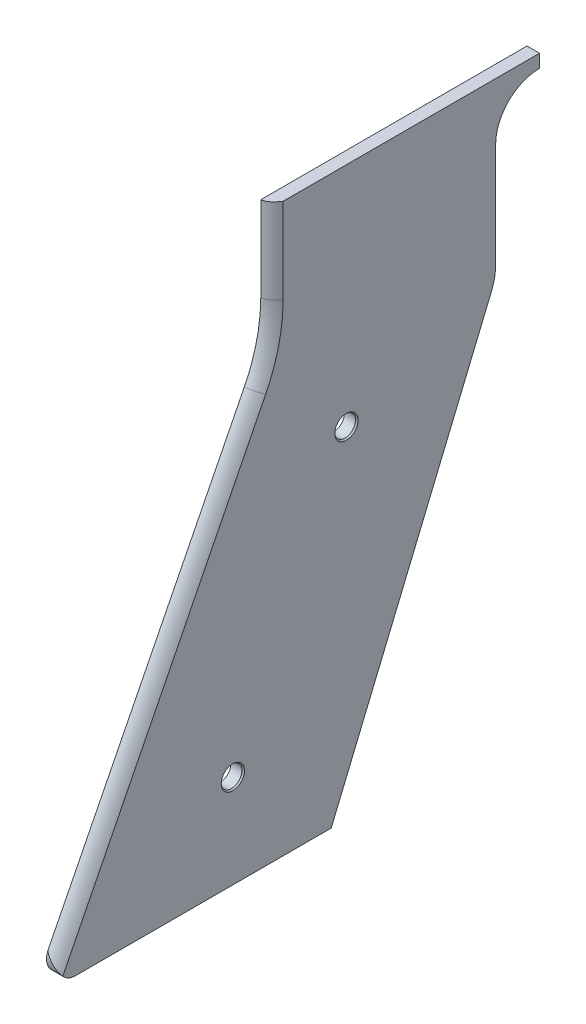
ISO-10303-21;
HEADER;
FILE_DESCRIPTION(('STEP AP214'),'2;1');
FILE_NAME('part.step','',(''),(''),'','','');
FILE_SCHEMA(('AUTOMOTIVE_DESIGN { 1 0 10303 214 1 1 1 1 }'));
ENDSEC;
DATA;
#1=APPLICATION_CONTEXT('core data for automotive mechanical design processes');
#2=APPLICATION_PROTOCOL_DEFINITION('international standard','automotive_design',2000,#1);
#3=PRODUCT_CONTEXT('',#1,'mechanical');
#4=PRODUCT('Part','Part','',(#3));
#5=PRODUCT_RELATED_PRODUCT_CATEGORY('part','',(#4));
#6=PRODUCT_DEFINITION_FORMATION('','',#4);
#7=PRODUCT_DEFINITION_CONTEXT('part definition',#1,'design');
#8=PRODUCT_DEFINITION('design','',#6,#7);
#9=PRODUCT_DEFINITION_SHAPE('','',#8);
#10=(LENGTH_UNIT() NAMED_UNIT(*) SI_UNIT(.MILLI.,.METRE.));
#11=(NAMED_UNIT(*) PLANE_ANGLE_UNIT() SI_UNIT($,.RADIAN.));
#12=(NAMED_UNIT(*) SI_UNIT($,.STERADIAN.) SOLID_ANGLE_UNIT());
#13=UNCERTAINTY_MEASURE_WITH_UNIT(LENGTH_MEASURE(1.E-05),#10,'distance_accuracy_value','');
#14=(GEOMETRIC_REPRESENTATION_CONTEXT(3) GLOBAL_UNCERTAINTY_ASSIGNED_CONTEXT((#13)) GLOBAL_UNIT_ASSIGNED_CONTEXT((#10,
#11,#12)) REPRESENTATION_CONTEXT('',''));
#15=CARTESIAN_POINT('',(0.,0.,0.));
#16=DIRECTION('',(0.,0.,1.));
#17=DIRECTION('',(1.,0.,0.));
#18=AXIS2_PLACEMENT_3D('',#15,#16,#17);
#19=CARTESIAN_POINT('',(0.,79.6090693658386,18.7495007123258));
#20=DIRECTION('',(-1.,0.,0.));
#21=DIRECTION('',(0.,0.,1.));
#22=AXIS2_PLACEMENT_3D('',#19,#20,#21);
#23=PLANE('',#22);
#24=CARTESIAN_POINT('',(0.,-5.3110442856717,26.8327416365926));
#25=DIRECTION('',(-1.,0.,0.));
#26=DIRECTION('',(0.,0.,1.));
#27=AXIS2_PLACEMENT_3D('',#24,#25,#26);
#28=CIRCLE('',#27,3.00000000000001);
#29=CARTESIAN_POINT('',(1.40516375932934E-10,-3.96089212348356,29.5117506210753));
#30=VERTEX_POINT('',#29);
#31=CARTESIAN_POINT('',(0.,-8.31104428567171,26.8327416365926));
#32=VERTEX_POINT('',#31);
#33=EDGE_CURVE('E369',#30,#32,#28,.F.);
#34=ORIENTED_EDGE('',*,*,#33,.F.);
#35=CARTESIAN_POINT('',(1.61729640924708E-11,67.007649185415,-6.25458314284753));
#36=CARTESIAN_POINT('',(-6.23106974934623E-12,40.6461064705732,7.03096166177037));
#37=CARTESIAN_POINT('',(3.36979167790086E-12,14.2845637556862,20.3165064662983));
#38=CARTESIAN_POINT('',(1.61720967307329E-11,-12.0769789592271,33.6020512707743));
#39=(BOUNDED_CURVE() B_SPLINE_CURVE(3,(#35,#36,#37,#38),.UNSPECIFIED.,.F.,
.F.) B_SPLINE_CURVE_WITH_KNOTS((4,4),(0.,0.0885603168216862),
.UNSPECIFIED.) CURVE() GEOMETRIC_REPRESENTATION_ITEM() RATIONAL_B_SPLINE_CURVE((0.999999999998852,
0.999999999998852,0.999999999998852,0.999999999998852)) REPRESENTATION_ITEM(''));
#40=CARTESIAN_POINT('',(0.,67.0076491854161,-6.25458314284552));
#41=VERTEX_POINT('',#40);
#42=EDGE_CURVE('E75',#41,#30,#39,.T.);
#43=ORIENTED_EDGE('',*,*,#42,.F.);
#44=CARTESIAN_POINT('',(0.,79.6090693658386,-9.2504992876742));
#45=CARTESIAN_POINT('',(6.86447822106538E-13,77.430516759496,-9.25049928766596));
#46=CARTESIAN_POINT('',(-6.86865962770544E-13,75.2521702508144,-8.99510789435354));
#47=CARTESIAN_POINT('',(6.8643228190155E-13,71.0133122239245,-7.98734345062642));
#48=CARTESIAN_POINT('',(-4.46310346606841E-12,68.9531031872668,-7.23504231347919));
#49=CARTESIAN_POINT('',(0.,67.0076491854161,-6.25458314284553));
#50=(BOUNDED_CURVE() B_SPLINE_CURVE(3,(#44,#45,#46,#47,#48,#49),.UNSPECIFIED.,.F.,
.F.) B_SPLINE_CURVE_WITH_KNOTS((4,2,4),(3.14159265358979,3.37500372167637,3.60841478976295),
.UNSPECIFIED.) CURVE() GEOMETRIC_REPRESENTATION_ITEM() RATIONAL_B_SPLINE_CURVE((1.,1.,1.,1.,1.,1.)) REPRESENTATION_ITEM(''));
#51=CARTESIAN_POINT('',(0.,79.6090693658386,-9.2504992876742));
#52=VERTEX_POINT('',#51);
#53=EDGE_CURVE('E183',#52,#41,#50,.T.);
#54=ORIENTED_EDGE('',*,*,#53,.F.);
#55=CARTESIAN_POINT('',(0.,95.8629500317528,-9.2504992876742));
#56=CARTESIAN_POINT('',(0.,90.4449898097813,-9.2504992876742));
#57=CARTESIAN_POINT('',(0.,85.0270295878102,-9.2504992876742));
#58=CARTESIAN_POINT('',(0.,79.6090693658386,-9.2504992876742));
#59=(BOUNDED_CURVE() B_SPLINE_CURVE(3,(#55,#56,#57,#58),.UNSPECIFIED.,.F.,
.F.) B_SPLINE_CURVE_WITH_KNOTS((4,4),(-0.0162538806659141,0.),
.UNSPECIFIED.) CURVE() GEOMETRIC_REPRESENTATION_ITEM() RATIONAL_B_SPLINE_CURVE((1.,1.,1.,1.)) REPRESENTATION_ITEM(''));
#60=CARTESIAN_POINT('',(0.,95.0889557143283,-9.2504992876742));
#61=VERTEX_POINT('',#60);
#62=EDGE_CURVE('E293',#61,#52,#59,.T.);
#63=ORIENTED_EDGE('',*,*,#62,.F.);
#64=DIRECTION('',(0.,0.,1.));
#65=VECTOR('',#64,1.);
#66=CARTESIAN_POINT('',(0.,95.0889557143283,-57.8074690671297));
#67=LINE('',#66,#65);
#68=CARTESIAN_POINT('',(0.,95.0889557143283,-57.8074690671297));
#69=VERTEX_POINT('',#68);
#70=EDGE_CURVE('E201',#69,#61,#67,.T.);
#71=ORIENTED_EDGE('',*,*,#70,.F.);
#72=DIRECTION('',(0.,1.,0.));
#73=VECTOR('',#72,1.);
#74=CARTESIAN_POINT('',(0.,92.6889557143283,-57.8074690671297));
#75=LINE('',#74,#73);
#76=CARTESIAN_POINT('',(0.,92.6889557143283,-57.8074690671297));
#77=VERTEX_POINT('',#76);
#78=EDGE_CURVE('E173',#77,#69,#75,.T.);
#79=ORIENTED_EDGE('',*,*,#78,.F.);
#80=CARTESIAN_POINT('',(0.,84.6889557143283,-57.8074690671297));
#81=DIRECTION('',(-1.,0.,0.));
#82=DIRECTION('',(0.,0.,1.));
#83=AXIS2_PLACEMENT_3D('',#80,#81,#82);
#84=CIRCLE('',#83,8.);
#85=CARTESIAN_POINT('',(0.,84.6889557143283,-49.8074690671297));
#86=VERTEX_POINT('',#85);
#87=EDGE_CURVE('E392',#86,#77,#84,.T.);
#88=ORIENTED_EDGE('',*,*,#87,.F.);
#89=DIRECTION('',(0.,1.,0.));
#90=VECTOR('',#89,1.);
#91=CARTESIAN_POINT('',(0.,65.6889557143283,-49.8074690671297));
#92=LINE('',#91,#90);
#93=CARTESIAN_POINT('',(0.,65.6889557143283,-49.8074690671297));
#94=VERTEX_POINT('',#93);
#95=EDGE_CURVE('E389',#94,#86,#92,.T.);
#96=ORIENTED_EDGE('',*,*,#95,.F.);
#97=CARTESIAN_POINT('',(0.,65.6889557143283,-39.8074690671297));
#98=DIRECTION('',(1.,0.,0.));
#99=DIRECTION('',(0.,0.,1.));
#100=AXIS2_PLACEMENT_3D('',#97,#98,#99);
#101=CIRCLE('',#100,10.);
#102=CARTESIAN_POINT('',(0.,61.8428018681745,-49.038238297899));
#103=VERTEX_POINT('',#102);
#104=EDGE_CURVE('E385',#103,#94,#101,.T.);
#105=ORIENTED_EDGE('',*,*,#104,.F.);
#106=DIRECTION('',(0.,0.923076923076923,-0.384615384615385));
#107=VECTOR('',#106,1.);
#108=CARTESIAN_POINT('',(0.,61.8428018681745,-49.038238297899));
#109=LINE('',#108,#107);
#110=CARTESIAN_POINT('',(0.,-8.3110442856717,-19.8074690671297));
#111=VERTEX_POINT('',#110);
#112=EDGE_CURVE('E381',#111,#103,#109,.T.);
#113=ORIENTED_EDGE('',*,*,#112,.F.);
#114=DIRECTION('',(0.,0.,-1.));
#115=VECTOR('',#114,1.);
#116=CARTESIAN_POINT('',(0.,-8.3110442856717,-19.8074690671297));
#117=LINE('',#116,#115);
#118=EDGE_CURVE('E304',#32,#111,#117,.T.);
#119=ORIENTED_EDGE('',*,*,#118,.F.);
#120=EDGE_LOOP('',(#34,#43,#54,#63,#71,#79,#88,#96,#105,#113,#119));
#121=FACE_BOUND('',#120,.T.);
#122=CARTESIAN_POINT('',(0.,53.6889557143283,-22.5915519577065));
#123=DIRECTION('',(1.,0.,0.));
#124=DIRECTION('',(0.,0.,-1.));
#125=AXIS2_PLACEMENT_3D('',#122,#123,#124);
#126=CIRCLE('',#125,1.905);
#127=CARTESIAN_POINT('',(0.,53.6889557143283,-24.4965519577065));
#128=VERTEX_POINT('',#127);
#129=EDGE_CURVE('E376',#128,#128,#126,.T.);
#130=ORIENTED_EDGE('',*,*,#129,.T.);
#131=EDGE_LOOP('',(#130));
#132=FACE_BOUND('',#131,.T.);
#133=CARTESIAN_POINT('',(0.,8.68895571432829,-1.87712613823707));
#134=DIRECTION('',(1.,0.,0.));
#135=DIRECTION('',(0.,0.,-1.));
#136=AXIS2_PLACEMENT_3D('',#133,#134,#135);
#137=CIRCLE('',#136,1.905);
#138=CARTESIAN_POINT('',(0.,8.68895571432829,-3.78212613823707));
#139=VERTEX_POINT('',#138);
#140=EDGE_CURVE('E373',#139,#139,#137,.T.);
#141=ORIENTED_EDGE('',*,*,#140,.T.);
#142=EDGE_LOOP('',(#141));
#143=FACE_BOUND('',#142,.T.);
#144=ADVANCED_FACE('F45',(#121,#132,#143),#23,.T.);
#145=CARTESIAN_POINT('',(4.572,-8.3110442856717,-19.8074690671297));
#146=DIRECTION('',(0.,1.,0.));
#147=DIRECTION('',(0.,0.,1.));
#148=AXIS2_PLACEMENT_3D('',#145,#146,#147);
#149=PLANE('',#148);
#150=DIRECTION('',(-1.,0.,0.));
#151=VECTOR('',#150,1.);
#152=CARTESIAN_POINT('',(4.572,-8.3110442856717,-19.8074690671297));
#153=LINE('',#152,#151);
#154=CARTESIAN_POINT('',(2.286,-8.3110442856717,-19.8074690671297));
#155=VERTEX_POINT('',#154);
#156=EDGE_CURVE('E195',#155,#111,#153,.T.);
#157=ORIENTED_EDGE('',*,*,#156,.F.);
#158=DIRECTION('',(0.,0.,1.));
#159=VECTOR('',#158,1.);
#160=CARTESIAN_POINT('',(2.286,-8.3110442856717,-19.8074690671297));
#161=LINE('',#160,#159);
#162=CARTESIAN_POINT('',(2.28600000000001,-8.31104428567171,26.8327416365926));
#163=VERTEX_POINT('',#162);
#164=EDGE_CURVE('E320',#155,#163,#161,.T.);
#165=ORIENTED_EDGE('',*,*,#164,.T.);
#166=DIRECTION('',(1.,0.,0.));
#167=VECTOR('',#166,1.);
#168=CARTESIAN_POINT('',(-0.0317599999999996,-8.31104428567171,26.8327416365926));
#169=LINE('',#168,#167);
#170=EDGE_CURVE('E364',#32,#163,#169,.T.);
#171=ORIENTED_EDGE('',*,*,#170,.F.);
#172=ORIENTED_EDGE('',*,*,#118,.T.);
#173=EDGE_LOOP('',(#157,#165,#171,#172));
#174=FACE_BOUND('',#173,.T.);
#175=ADVANCED_FACE('F232',(#174),#149,.F.);
#176=CARTESIAN_POINT('',(4.572,61.8428018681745,-49.038238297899));
#177=DIRECTION('',(0.,0.384615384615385,0.923076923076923));
#178=DIRECTION('',(0.,-0.923076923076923,0.384615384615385));
#179=AXIS2_PLACEMENT_3D('',#176,#177,#178);
#180=PLANE('',#179);
#181=DIRECTION('',(-1.,0.,0.));
#182=VECTOR('',#181,1.);
#183=CARTESIAN_POINT('',(4.572,61.8428018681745,-49.038238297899));
#184=LINE('',#183,#182);
#185=CARTESIAN_POINT('',(2.286,61.8428018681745,-49.038238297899));
#186=VERTEX_POINT('',#185);
#187=EDGE_CURVE('E192',#186,#103,#184,.T.);
#188=ORIENTED_EDGE('',*,*,#187,.F.);
#189=DIRECTION('',(0.,-0.923076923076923,0.384615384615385));
#190=VECTOR('',#189,1.);
#191=CARTESIAN_POINT('',(2.286,61.8428018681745,-49.038238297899));
#192=LINE('',#191,#190);
#193=EDGE_CURVE('E346',#186,#155,#192,.T.);
#194=ORIENTED_EDGE('',*,*,#193,.T.);
#195=ORIENTED_EDGE('',*,*,#156,.T.);
#196=ORIENTED_EDGE('',*,*,#112,.T.);
#197=EDGE_LOOP('',(#188,#194,#195,#196));
#198=FACE_BOUND('',#197,.T.);
#199=ADVANCED_FACE('F228',(#198),#180,.F.);
#200=CARTESIAN_POINT('',(4.572,65.6889557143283,-39.8074690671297));
#201=DIRECTION('',(-1.,0.,0.));
#202=DIRECTION('',(0.,0.,1.));
#203=AXIS2_PLACEMENT_3D('',#200,#201,#202);
#204=CYLINDRICAL_SURFACE('',#203,10.);
#205=DIRECTION('',(-1.,0.,0.));
#206=VECTOR('',#205,1.);
#207=CARTESIAN_POINT('',(4.572,65.6889557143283,-49.8074690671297));
#208=LINE('',#207,#206);
#209=CARTESIAN_POINT('',(2.286,65.6889557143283,-49.8074690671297));
#210=VERTEX_POINT('',#209);
#211=EDGE_CURVE('E189',#210,#94,#208,.T.);
#212=ORIENTED_EDGE('',*,*,#211,.F.);
#213=CARTESIAN_POINT('',(2.286,65.6889557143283,-39.8074690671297));
#214=DIRECTION('',(-1.,0.,0.));
#215=DIRECTION('',(0.,0.,1.));
#216=AXIS2_PLACEMENT_3D('',#213,#214,#215);
#217=CIRCLE('',#216,10.);
#218=EDGE_CURVE('E352',#210,#186,#217,.T.);
#219=ORIENTED_EDGE('',*,*,#218,.T.);
#220=ORIENTED_EDGE('',*,*,#187,.T.);
#221=ORIENTED_EDGE('',*,*,#104,.T.);
#222=EDGE_LOOP('',(#212,#219,#220,#221));
#223=FACE_BOUND('',#222,.T.);
#224=ADVANCED_FACE('F224',(#223),#204,.T.);
#225=CARTESIAN_POINT('',(4.572,65.6889557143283,-49.8074690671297));
#226=DIRECTION('',(0.,0.,1.));
#227=DIRECTION('',(0.,-1.,0.));
#228=AXIS2_PLACEMENT_3D('',#225,#226,#227);
#229=PLANE('',#228);
#230=DIRECTION('',(-1.,0.,0.));
#231=VECTOR('',#230,1.);
#232=CARTESIAN_POINT('',(4.572,84.6889557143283,-49.8074690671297));
#233=LINE('',#232,#231);
#234=CARTESIAN_POINT('',(2.286,84.6889557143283,-49.8074690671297));
#235=VERTEX_POINT('',#234);
#236=EDGE_CURVE('E180',#235,#86,#233,.T.);
#237=ORIENTED_EDGE('',*,*,#236,.F.);
#238=DIRECTION('',(0.,-1.,0.));
#239=VECTOR('',#238,1.);
#240=CARTESIAN_POINT('',(2.286,65.6889557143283,-49.8074690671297));
#241=LINE('',#240,#239);
#242=EDGE_CURVE('E358',#235,#210,#241,.T.);
#243=ORIENTED_EDGE('',*,*,#242,.T.);
#244=ORIENTED_EDGE('',*,*,#211,.T.);
#245=ORIENTED_EDGE('',*,*,#95,.T.);
#246=EDGE_LOOP('',(#237,#243,#244,#245));
#247=FACE_BOUND('',#246,.T.);
#248=ADVANCED_FACE('F220',(#247),#229,.F.);
#249=CARTESIAN_POINT('',(4.572,84.6889557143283,-57.8074690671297));
#250=DIRECTION('',(-1.,0.,0.));
#251=DIRECTION('',(0.,0.,1.));
#252=AXIS2_PLACEMENT_3D('',#249,#250,#251);
#253=CYLINDRICAL_SURFACE('',#252,8.);
#254=DIRECTION('',(-1.,0.,0.));
#255=VECTOR('',#254,1.);
#256=CARTESIAN_POINT('',(4.572,92.6889557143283,-57.8074690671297));
#257=LINE('',#256,#255);
#258=CARTESIAN_POINT('',(2.286,92.6889557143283,-57.8074690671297));
#259=VERTEX_POINT('',#258);
#260=EDGE_CURVE('E176',#259,#77,#257,.T.);
#261=ORIENTED_EDGE('',*,*,#260,.F.);
#262=CARTESIAN_POINT('',(2.286,84.6889557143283,-57.8074690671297));
#263=DIRECTION('',(-1.,0.,0.));
#264=DIRECTION('',(0.,0.,1.));
#265=AXIS2_PLACEMENT_3D('',#262,#263,#264);
#266=CIRCLE('',#265,8.);
#267=EDGE_CURVE('E154',#259,#235,#266,.F.);
#268=ORIENTED_EDGE('',*,*,#267,.T.);
#269=ORIENTED_EDGE('',*,*,#236,.T.);
#270=ORIENTED_EDGE('',*,*,#87,.T.);
#271=EDGE_LOOP('',(#261,#268,#269,#270));
#272=FACE_BOUND('',#271,.T.);
#273=ADVANCED_FACE('F217',(#272),#253,.F.);
#274=CARTESIAN_POINT('',(4.572,92.6889557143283,-57.8074690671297));
#275=DIRECTION('',(0.,0.,1.));
#276=DIRECTION('',(1.,0.,0.));
#277=AXIS2_PLACEMENT_3D('',#274,#275,#276);
#278=PLANE('',#277);
#279=DIRECTION('',(-1.,0.,0.));
#280=VECTOR('',#279,1.);
#281=CARTESIAN_POINT('',(4.572,95.0889557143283,-57.8074690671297));
#282=LINE('',#281,#280);
#283=CARTESIAN_POINT('',(2.286,95.0889557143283,-57.8074690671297));
#284=VERTEX_POINT('',#283);
#285=EDGE_CURVE('E164',#284,#69,#282,.T.);
#286=ORIENTED_EDGE('',*,*,#285,.F.);
#287=DIRECTION('',(0.,1.,0.));
#288=VECTOR('',#287,1.);
#289=CARTESIAN_POINT('',(2.286,-12.7655379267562,-57.8074690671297));
#290=LINE('',#289,#288);
#291=EDGE_CURVE('E148',#259,#284,#290,.T.);
#292=ORIENTED_EDGE('',*,*,#291,.F.);
#293=ORIENTED_EDGE('',*,*,#260,.T.);
#294=ORIENTED_EDGE('',*,*,#78,.T.);
#295=EDGE_LOOP('',(#286,#292,#293,#294));
#296=FACE_BOUND('',#295,.T.);
#297=ADVANCED_FACE('F171',(#296),#278,.F.);
#298=CARTESIAN_POINT('',(4.572,95.0889557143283,-57.8074690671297));
#299=DIRECTION('',(0.,-1.,0.));
#300=DIRECTION('',(0.,0.,-1.));
#301=AXIS2_PLACEMENT_3D('',#298,#299,#300);
#302=PLANE('',#301);
#303=CARTESIAN_POINT('',(4.572,95.0889557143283,-21.8254233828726));
#304=CARTESIAN_POINT('',(4.572,95.0889557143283,-9.89694581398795));
#305=CARTESIAN_POINT('',(0.,95.0889557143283,-9.2504992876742));
#306=(BOUNDED_CURVE() B_SPLINE_CURVE(2,(#303,#304,#305),.UNSPECIFIED.,.F.,
.F.) B_SPLINE_CURVE_WITH_KNOTS((3,3),(0.,1.),
.UNSPECIFIED.) CURVE() GEOMETRIC_REPRESENTATION_ITEM() RATIONAL_B_SPLINE_CURVE((1.,
0.754983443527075,1.)) REPRESENTATION_ITEM(''));
#307=CARTESIAN_POINT('',(2.28600000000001,95.0889557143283,-11.0528433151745));
#308=VERTEX_POINT('',#307);
#309=EDGE_CURVE('E167',#61,#308,#306,.F.);
#310=ORIENTED_EDGE('',*,*,#309,.T.);
#311=DIRECTION('',(0.,0.,1.));
#312=VECTOR('',#311,1.);
#313=CARTESIAN_POINT('',(2.286,95.0889557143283,-57.8074690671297));
#314=LINE('',#313,#312);
#315=EDGE_CURVE('E151',#284,#308,#314,.T.);
#316=ORIENTED_EDGE('',*,*,#315,.F.);
#317=ORIENTED_EDGE('',*,*,#285,.T.);
#318=ORIENTED_EDGE('',*,*,#70,.T.);
#319=EDGE_LOOP('',(#310,#316,#317,#318));
#320=FACE_BOUND('',#319,.T.);
#321=ADVANCED_FACE('F163',(#320),#302,.F.);
#322=CARTESIAN_POINT('',(4.572,53.6889557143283,-22.5915519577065));
#323=DIRECTION('',(-1.,0.,0.));
#324=DIRECTION('',(0.,0.,1.));
#325=AXIS2_PLACEMENT_3D('',#322,#323,#324);
#326=CYLINDRICAL_SURFACE('',#325,1.905);
#327=CARTESIAN_POINT('',(2.03199999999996,53.6889557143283,-22.5915519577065));
#328=DIRECTION('',(-1.,0.,0.));
#329=DIRECTION('',(0.,0.,1.));
#330=AXIS2_PLACEMENT_3D('',#327,#328,#329);
#331=CIRCLE('',#330,1.905);
#332=CARTESIAN_POINT('',(2.03199999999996,53.6889557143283,-20.6865519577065));
#333=VERTEX_POINT('',#332);
#334=EDGE_CURVE('E12',#333,#333,#331,.F.);
#335=ORIENTED_EDGE('',*,*,#334,.T.);
#336=EDGE_LOOP('',(#335));
#337=FACE_BOUND('',#336,.T.);
#338=ORIENTED_EDGE('',*,*,#129,.F.);
#339=EDGE_LOOP('',(#338));
#340=FACE_BOUND('',#339,.T.);
#341=ADVANCED_FACE('F212',(#337,#340),#326,.F.);
#342=CARTESIAN_POINT('',(4.572,8.68895571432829,-1.87712613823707));
#343=DIRECTION('',(-1.,0.,0.));
#344=DIRECTION('',(0.,0.,1.));
#345=AXIS2_PLACEMENT_3D('',#342,#343,#344);
#346=CYLINDRICAL_SURFACE('',#345,1.905);
#347=CARTESIAN_POINT('',(2.03199999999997,8.68895571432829,-1.87712613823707));
#348=DIRECTION('',(-1.,0.,0.));
#349=DIRECTION('',(0.,0.,1.));
#350=AXIS2_PLACEMENT_3D('',#347,#348,#349);
#351=CIRCLE('',#350,1.905);
#352=CARTESIAN_POINT('',(2.03199999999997,8.68895571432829,0.0278738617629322));
#353=VERTEX_POINT('',#352);
#354=EDGE_CURVE('E56',#353,#353,#351,.F.);
#355=ORIENTED_EDGE('',*,*,#354,.T.);
#356=EDGE_LOOP('',(#355));
#357=FACE_BOUND('',#356,.T.);
#358=ORIENTED_EDGE('',*,*,#140,.F.);
#359=EDGE_LOOP('',(#358));
#360=FACE_BOUND('',#359,.T.);
#361=ADVANCED_FACE('F483',(#357,#360),#346,.F.);
#362=CARTESIAN_POINT('',(4.572,61.3482955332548,-17.4840280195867));
#363=CARTESIAN_POINT('',(4.572,34.9867528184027,-4.19848321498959));
#364=CARTESIAN_POINT('',(4.572,8.62521010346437,9.08706158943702));
#365=CARTESIAN_POINT('',(4.572,-17.7363326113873,22.3726063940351));
#366=CARTESIAN_POINT('',(4.572,66.7167154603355,-6.83186182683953));
#367=CARTESIAN_POINT('',(4.572,40.3551727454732,6.4536829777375));
#368=CARTESIAN_POINT('',(4.57199999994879,13.9936300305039,19.7392277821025));
#369=CARTESIAN_POINT('',(4.572,-12.3679126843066,33.0247725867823));
#370=CARTESIAN_POINT('',(0.,67.007649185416,-6.25458314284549));
#371=CARTESIAN_POINT('',(-2.24031664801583E-11,40.6461064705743,7.03096166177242));
#372=CARTESIAN_POINT('',(-1.28023050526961E-11,14.2845637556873,20.3165064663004));
#373=CARTESIAN_POINT('',(0.,-12.0769789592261,33.6020512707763));
#374=(BOUNDED_SURFACE() B_SPLINE_SURFACE(2,3,((#362,#363,#364,#365),(#366,#367,#368,#369),(#370,
#371,#372,#373)),.UNSPECIFIED.,.F.,.F.,.F.) B_SPLINE_SURFACE_WITH_KNOTS((3,3),(4,4),(0.,1.),(0.,
0.0885603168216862),
.UNSPECIFIED.) GEOMETRIC_REPRESENTATION_ITEM() RATIONAL_B_SPLINE_SURFACE(((1.,1.,1.,1.),
(0.754983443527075,0.754983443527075,0.754983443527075,0.754983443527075),(1.,1.,1.,1.))) REPRESENTATION_ITEM('') SURFACE());
#375=CARTESIAN_POINT('',(2.28600000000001,66.1964528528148,-7.86418117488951));
#376=CARTESIAN_POINT('',(2.28600000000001,63.2370960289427,-6.3727408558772));
#377=CARTESIAN_POINT('',(2.28600000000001,60.2777392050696,-4.88130053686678));
#378=CARTESIAN_POINT('',(2.28600000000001,51.3996687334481,-0.406979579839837));
#379=CARTESIAN_POINT('',(2.28600000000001,45.4809550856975,2.57590105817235));
#380=CARTESIAN_POINT('',(2.28600000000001,33.6435277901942,8.54166233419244));
#381=CARTESIAN_POINT('',(2.28600000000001,27.7248141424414,11.5245429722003));
#382=CARTESIAN_POINT('',(2.28600000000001,11.9007571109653,19.4994638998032));
#383=CARTESIAN_POINT('',(2.28600000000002,1.99541372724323,24.4915041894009));
#384=CARTESIAN_POINT('',(2.28600000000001,-7.90992965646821,29.4835444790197));
#385=B_SPLINE_CURVE_WITH_KNOTS('',3,(#375,#376,#377,#378,#379,#380,#381,#382,#383,#384),
.UNSPECIFIED.,.F.,.F.,(4,2,2,2,4),(0.,9.94181489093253,29.8254446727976,49.7090744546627,
82.9855923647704),.UNSPECIFIED.);
#386=CARTESIAN_POINT('',(2.28600000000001,66.1964528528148,-7.86418117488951));
#387=VERTEX_POINT('',#386);
#388=CARTESIAN_POINT('',(2.28600000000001,-7.22839652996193,29.1400691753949));
#389=VERTEX_POINT('',#388);
#390=EDGE_CURVE('E64',#387,#389,#385,.T.);
#391=CARTESIAN_POINT('',(0.,67.0076491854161,-6.25458314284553));
#392=CARTESIAN_POINT('',(4.572,66.7167154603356,-6.83186182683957));
#393=CARTESIAN_POINT('',(4.572,61.3482955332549,-17.4840280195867));
#394=(BOUNDED_CURVE() B_SPLINE_CURVE(2,(#391,#392,#393),.UNSPECIFIED.,.F.,
.F.) B_SPLINE_CURVE_WITH_KNOTS((3,3),(0.,1.),
.UNSPECIFIED.) CURVE() GEOMETRIC_REPRESENTATION_ITEM() RATIONAL_B_SPLINE_CURVE((1.,
0.754983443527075,1.)) REPRESENTATION_ITEM(''));
#395=EDGE_CURVE('E377',#41,#387,#394,.T.);
#396=CARTESIAN_POINT('',(3.43793325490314,-8.3110442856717,26.8327416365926));
#397=CARTESIAN_POINT('',(3.41222037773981,-8.31105666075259,26.9210966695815));
#398=CARTESIAN_POINT('',(3.38535990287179,-8.30714158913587,27.0091009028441));
#399=CARTESIAN_POINT('',(3.32938204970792,-8.29173199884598,27.1836781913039));
#400=CARTESIAN_POINT('',(3.30026562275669,-8.28024065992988,27.270251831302));
#401=CARTESIAN_POINT('',(3.23991150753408,-8.25001311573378,27.4409771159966));
#402=CARTESIAN_POINT('',(3.20868261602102,-8.23130559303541,27.5251369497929));
#403=CARTESIAN_POINT('',(3.14406047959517,-8.18700961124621,27.6907516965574));
#404=CARTESIAN_POINT('',(3.11066706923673,-8.16142062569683,27.7722064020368));
#405=CARTESIAN_POINT('',(3.00740923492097,-8.07497883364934,28.0114371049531));
#406=CARTESIAN_POINT('',(2.93434020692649,-8.0043846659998,28.1644426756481));
#407=CARTESIAN_POINT('',(2.78039463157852,-7.84091830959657,28.4536718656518));
#408=CARTESIAN_POINT('',(2.69951175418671,-7.74802796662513,28.5898816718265));
#409=CARTESIAN_POINT('',(2.52518397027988,-7.53727329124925,28.8511224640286));
#410=CARTESIAN_POINT('',(2.43126327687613,-7.4181718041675,28.974837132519));
#411=CARTESIAN_POINT('',(2.23652256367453,-7.16411680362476,29.198063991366));
#412=CARTESIAN_POINT('',(2.13570151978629,-7.02916093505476,29.2975725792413));
#413=CARTESIAN_POINT('',(1.91745797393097,-6.7334120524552,29.4804102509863));
#414=CARTESIAN_POINT('',(1.79939869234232,-6.57139129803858,29.5609863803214));
#415=CARTESIAN_POINT('',(1.5575048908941,-6.23912346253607,29.691158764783));
#416=CARTESIAN_POINT('',(1.43366350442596,-6.06886659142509,29.7407171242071));
#417=CARTESIAN_POINT('',(1.23783492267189,-5.80156322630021,29.7939767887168));
#418=CARTESIAN_POINT('',(1.16718551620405,-5.7055045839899,29.8082671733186));
#419=CARTESIAN_POINT('',(1.02492489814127,-5.51310819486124,29.8274890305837));
#420=CARTESIAN_POINT('',(0.953313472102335,-5.41677038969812,29.8324183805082));
#421=CARTESIAN_POINT('',(0.809730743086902,-5.22470728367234,29.8330335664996));
#422=CARTESIAN_POINT('',(0.737760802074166,-5.12898105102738,29.8287426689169));
#423=CARTESIAN_POINT('',(0.629936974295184,-4.98599436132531,29.8154638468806));
#424=CARTESIAN_POINT('',(0.594022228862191,-4.93843874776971,29.8098983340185));
#425=CARTESIAN_POINT('',(0.522372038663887,-4.84351858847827,29.7964754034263));
#426=CARTESIAN_POINT('',(0.486636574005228,-4.79615402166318,29.7886182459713));
#427=CARTESIAN_POINT('',(0.427307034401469,-4.71718453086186,29.7735527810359));
#428=CARTESIAN_POINT('',(0.403600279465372,-4.68554015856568,29.7669869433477));
#429=CARTESIAN_POINT('',(0.356481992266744,-4.62227343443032,29.7527837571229));
#430=CARTESIAN_POINT('',(0.333070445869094,-4.59065108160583,29.7451464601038));
#431=CARTESIAN_POINT('',(0.286631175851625,-4.52724647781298,29.728728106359));
#432=CARTESIAN_POINT('',(0.263605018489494,-4.49546404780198,29.7199432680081));
#433=CARTESIAN_POINT('',(0.218318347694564,-4.43171805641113,29.701171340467));
#434=CARTESIAN_POINT('',(0.196057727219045,-4.39975452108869,29.6911844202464));
#435=CARTESIAN_POINT('',(0.149262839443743,-4.33018113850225,29.6681366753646));
#436=CARTESIAN_POINT('',(0.124946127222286,-4.29249704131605,29.6548400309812));
#437=CARTESIAN_POINT('',(0.0911359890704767,-4.23523551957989,29.6332852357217));
#438=CARTESIAN_POINT('',(0.0803510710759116,-4.21611005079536,29.6258674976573));
#439=CARTESIAN_POINT('',(0.0600281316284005,-4.17744158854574,29.6103987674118));
#440=CARTESIAN_POINT('',(0.0504900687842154,-4.15789860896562,29.602347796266));
#441=CARTESIAN_POINT('',(0.0356993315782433,-4.12392315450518,29.5879150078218));
#442=CARTESIAN_POINT('',(0.0299985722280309,-4.10961377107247,29.5817076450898));
#443=CARTESIAN_POINT('',(0.0198382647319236,-4.08074556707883,29.5689094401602));
#444=CARTESIAN_POINT('',(0.015377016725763,-4.06618711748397,29.5623191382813));
#445=CARTESIAN_POINT('',(0.00795183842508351,-4.03657810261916,29.5486218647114));
#446=CARTESIAN_POINT('',(0.00501670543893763,-4.02152340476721,29.5415076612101));
#447=CARTESIAN_POINT('',(0.0010201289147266,-3.99126299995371,29.5268954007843));
#448=CARTESIAN_POINT('',(-3.19159966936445E-05,-3.9760569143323,29.5193956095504));
#449=CARTESIAN_POINT('',(1.40516378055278E-10,-3.96089212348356,29.5117506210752));
#450=B_SPLINE_CURVE_WITH_KNOTS('',3,(#396,#397,#398,#399,#400,#401,#402,#403,#404,#405,#406,
#407,#408,#409,#410,#411,#412,#413,#414,#415,#416,#417,#418,#419,#420,#421,#422,#423,#424,#425,
#426,#427,#428,#429,#430,#431,#432,#433,#434,#435,#436,#437,#438,#439,#440,#441,#442,#443,#444,
#445,#446,#447,#448,#449),.UNSPECIFIED.,.F.,.F.,(4,2,2,2,2,2,2,2,2,2,2,2,2,2,2,2,2,2,2,2,2,2,2,
2,2,2,4),(0.,0.275945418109,0.551775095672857,0.826519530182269,1.10128498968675,
1.64965948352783,2.19848200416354,2.78324730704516,3.36809958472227,4.01368132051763,
4.6600502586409,5.02001692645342,5.3800652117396,5.73920601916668,5.91872952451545,
6.09823264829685,6.21846233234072,6.3386862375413,6.45931682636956,6.57993047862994,
6.72012446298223,6.78962293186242,6.85911909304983,6.90889906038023,6.95861041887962,
7.0092285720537,7.06009866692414),.UNSPECIFIED.);
#451=EDGE_CURVE('E49',#389,#30,#450,.T.);
#452=ORIENTED_EDGE('',*,*,#390,.F.);
#453=ORIENTED_EDGE('',*,*,#395,.F.);
#454=ORIENTED_EDGE('',*,*,#42,.T.);
#455=ORIENTED_EDGE('',*,*,#451,.F.);
#456=EDGE_LOOP('',(#452,#453,#454,#455));
#457=FACE_BOUND('',#456,.T.);
#458=ADVANCED_FACE('F329',(#457),#374,.T.);
#459=CARTESIAN_POINT('',(4.572,79.6090693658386,-21.8254233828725));
#460=CARTESIAN_POINT('',(4.572,76.4521191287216,-21.8254233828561));
#461=CARTESIAN_POINT('',(4.572,73.2954675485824,-21.4553345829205));
#462=CARTESIAN_POINT('',(4.572,67.1529195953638,-19.9949786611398));
#463=CARTESIAN_POINT('',(4.572,64.1674615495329,-18.9048157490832));
#464=CARTESIAN_POINT('',(4.572,61.3482955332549,-17.4840280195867));
#465=CARTESIAN_POINT('',(4.572,79.6090693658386,-9.89694581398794));
#466=CARTESIAN_POINT('',(4.57199999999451,77.3802196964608,-9.89694581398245));
#467=CARTESIAN_POINT('',(4.57199999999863,75.1515808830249,-9.6356581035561));
#468=CARTESIAN_POINT('',(4.57200000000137,70.8148587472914,-8.60462702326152));
#469=CARTESIAN_POINT('',(4.57200000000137,68.7070848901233,-7.83495722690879));
#470=CARTESIAN_POINT('',(4.572,66.7167154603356,-6.83186182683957));
#471=CARTESIAN_POINT('',(0.,79.6090693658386,-9.2504992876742));
#472=CARTESIAN_POINT('',(6.86447822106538E-13,77.430516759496,-9.25049928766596));
#473=CARTESIAN_POINT('',(-6.86865962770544E-13,75.2521702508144,-8.99510789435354));
#474=CARTESIAN_POINT('',(6.8643228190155E-13,71.0133122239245,-7.98734345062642));
#475=CARTESIAN_POINT('',(-4.46310346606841E-12,68.9531031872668,-7.23504231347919));
#476=CARTESIAN_POINT('',(0.,67.0076491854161,-6.25458314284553));
#477=(BOUNDED_SURFACE() B_SPLINE_SURFACE(2,3,((#459,#460,#461,#462,#463,#464),(#465,#466,#467,
#468,#469,#470),(#471,#472,#473,#474,#475,#476)),.UNSPECIFIED.,.F.,.F.,
.F.) B_SPLINE_SURFACE_WITH_KNOTS((3,3),(4,2,4),(0.,1.),(3.14159265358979,3.37500372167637,
3.60841478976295),.UNSPECIFIED.) GEOMETRIC_REPRESENTATION_ITEM() RATIONAL_B_SPLINE_SURFACE(((1.,
1.,1.,1.,1.,1.),(0.754983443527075,0.754983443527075,0.754983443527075,0.754983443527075,
0.754983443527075,0.754983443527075),(1.,1.,1.,1.,1.,1.))) REPRESENTATION_ITEM('') SURFACE());
#478=CARTESIAN_POINT('',(2.28600000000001,79.6090693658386,-11.0529546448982));
#479=CARTESIAN_POINT('',(2.28600000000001,78.7826534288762,-11.0529547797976));
#480=CARTESIAN_POINT('',(2.28600000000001,77.9562214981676,-11.0184243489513));
#481=CARTESIAN_POINT('',(2.286,76.3092890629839,-10.8809844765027));
#482=CARTESIAN_POINT('',(2.28599999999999,75.4887869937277,-10.7780937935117));
#483=CARTESIAN_POINT('',(2.286,73.9464028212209,-10.5192464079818));
#484=CARTESIAN_POINT('',(2.286,73.2233625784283,-10.370146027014));
#485=CARTESIAN_POINT('',(2.28600000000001,71.7904135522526,-10.0185082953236));
#486=CARTESIAN_POINT('',(2.286,71.0805042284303,-9.81597314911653));
#487=CARTESIAN_POINT('',(2.286,69.6615679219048,-9.35367301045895));
#488=CARTESIAN_POINT('',(2.286,68.9529330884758,-9.0927041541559));
#489=CARTESIAN_POINT('',(2.28600000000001,67.5573650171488,-8.51779889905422));
#490=CARTESIAN_POINT('',(2.28600000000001,66.870435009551,-8.20385465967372));
#491=CARTESIAN_POINT('',(2.286,66.1964528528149,-7.86418117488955));
#492=B_SPLINE_CURVE_WITH_KNOTS('',3,(#478,#479,#480,#481,#482,#483,#484,#485,#486,#487,#488,
#489,#490,#491),.UNSPECIFIED.,.F.,.F.,(4,2,2,2,2,2,4),(0.,2.47857891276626,4.95647796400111,
7.16923316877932,9.38189709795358,11.6452085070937,13.9088551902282),.UNSPECIFIED.);
#493=CARTESIAN_POINT('',(2.28600000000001,79.6090693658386,-11.0529546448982));
#494=VERTEX_POINT('',#493);
#495=EDGE_CURVE('E345',#494,#387,#492,.T.);
#496=CARTESIAN_POINT('',(0.,79.6090693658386,-9.2504992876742));
#497=CARTESIAN_POINT('',(4.572,79.6090693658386,-9.89694581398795));
#498=CARTESIAN_POINT('',(4.572,79.6090693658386,-21.8254233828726));
#499=(BOUNDED_CURVE() B_SPLINE_CURVE(2,(#496,#497,#498),.UNSPECIFIED.,.F.,
.F.) B_SPLINE_CURVE_WITH_KNOTS((3,3),(0.,1.),
.UNSPECIFIED.) CURVE() GEOMETRIC_REPRESENTATION_ITEM() RATIONAL_B_SPLINE_CURVE((1.,
0.754983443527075,1.)) REPRESENTATION_ITEM(''));
#500=EDGE_CURVE('E283',#52,#494,#499,.T.);
#501=ORIENTED_EDGE('',*,*,#495,.F.);
#502=ORIENTED_EDGE('',*,*,#500,.F.);
#503=ORIENTED_EDGE('',*,*,#53,.T.);
#504=ORIENTED_EDGE('',*,*,#395,.T.);
#505=EDGE_LOOP('',(#501,#502,#503,#504));
#506=FACE_BOUND('',#505,.T.);
#507=ADVANCED_FACE('F248',(#506),#477,.T.);
#508=CARTESIAN_POINT('',(4.572,95.8629500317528,-21.8254233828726));
#509=CARTESIAN_POINT('',(4.572,90.4449898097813,-21.8254233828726));
#510=CARTESIAN_POINT('',(4.572,85.0270295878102,-21.8254233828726));
#511=CARTESIAN_POINT('',(4.572,79.6090693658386,-21.8254233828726));
#512=CARTESIAN_POINT('',(4.572,95.8629500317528,-9.89694581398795));
#513=CARTESIAN_POINT('',(4.572,90.4449898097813,-9.89694581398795));
#514=CARTESIAN_POINT('',(4.572,85.0270295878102,-9.89694581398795));
#515=CARTESIAN_POINT('',(4.572,79.6090693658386,-9.89694581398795));
#516=CARTESIAN_POINT('',(0.,95.8629500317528,-9.2504992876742));
#517=CARTESIAN_POINT('',(0.,90.4449898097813,-9.2504992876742));
#518=CARTESIAN_POINT('',(0.,85.0270295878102,-9.2504992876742));
#519=CARTESIAN_POINT('',(0.,79.6090693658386,-9.2504992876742));
#520=(BOUNDED_SURFACE() B_SPLINE_SURFACE(2,3,((#508,#509,#510,#511),(#512,#513,#514,#515),(#516,
#517,#518,#519)),.UNSPECIFIED.,.F.,.F.,.F.) B_SPLINE_SURFACE_WITH_KNOTS((3,3),(4,4),(0.,1.),
(-0.0162538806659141,0.),
.UNSPECIFIED.) GEOMETRIC_REPRESENTATION_ITEM() RATIONAL_B_SPLINE_SURFACE(((1.,1.,1.,1.),
(0.754983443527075,0.754983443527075,0.754983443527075,0.754983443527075),(1.,1.,1.,1.))) REPRESENTATION_ITEM('') SURFACE());
#521=DIRECTION('',(0.,-1.,0.));
#522=VECTOR('',#521,1.);
#523=CARTESIAN_POINT('',(2.28600000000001,87.3490125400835,-11.0529546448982));
#524=LINE('',#523,#522);
#525=EDGE_CURVE('E294',#308,#494,#524,.T.);
#526=ORIENTED_EDGE('',*,*,#525,.F.);
#527=ORIENTED_EDGE('',*,*,#309,.F.);
#528=ORIENTED_EDGE('',*,*,#62,.T.);
#529=ORIENTED_EDGE('',*,*,#500,.T.);
#530=EDGE_LOOP('',(#526,#527,#528,#529));
#531=FACE_BOUND('',#530,.T.);
#532=ADVANCED_FACE('F238',(#531),#520,.T.);
#533=CARTESIAN_POINT('',(-0.0317599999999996,-5.3110442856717,26.8327416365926));
#534=DIRECTION('',(1.,0.,0.));
#535=DIRECTION('',(0.,0.,-1.));
#536=AXIS2_PLACEMENT_3D('',#533,#534,#535);
#537=CYLINDRICAL_SURFACE('',#536,3.00000000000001);
#538=ORIENTED_EDGE('',*,*,#170,.T.);
#539=CARTESIAN_POINT('',(2.28600000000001,-5.3110442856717,26.8327416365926));
#540=DIRECTION('',(-1.,0.,0.));
#541=DIRECTION('',(0.,0.,1.));
#542=AXIS2_PLACEMENT_3D('',#539,#540,#541);
#543=CIRCLE('',#542,3.00000000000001);
#544=EDGE_CURVE('E311',#163,#389,#543,.T.);
#545=ORIENTED_EDGE('',*,*,#544,.T.);
#546=ORIENTED_EDGE('',*,*,#451,.T.);
#547=ORIENTED_EDGE('',*,*,#33,.T.);
#548=EDGE_LOOP('',(#538,#545,#546,#547));
#549=FACE_BOUND('',#548,.T.);
#550=ADVANCED_FACE('F247',(#549),#537,.T.);
#551=CARTESIAN_POINT('',(2.03199999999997,8.68895571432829,-1.87712613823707));
#552=DIRECTION('',(1.,0.,0.));
#553=DIRECTION('',(0.,0.,-1.));
#554=AXIS2_PLACEMENT_3D('',#551,#552,#553);
#555=CONICAL_SURFACE('',#554,1.905,0.715584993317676);
#556=CARTESIAN_POINT('',(2.28600000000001,8.68895571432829,-1.87712613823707));
#557=DIRECTION('',(-1.,0.,0.));
#558=DIRECTION('',(0.,0.,1.));
#559=AXIS2_PLACEMENT_3D('',#556,#557,#558);
#560=CIRCLE('',#559,2.12579883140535);
#561=CARTESIAN_POINT('',(2.28600000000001,8.68895571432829,0.248672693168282));
#562=VERTEX_POINT('',#561);
#563=EDGE_CURVE('E307',#562,#562,#560,.T.);
#564=ORIENTED_EDGE('',*,*,#563,.F.);
#565=EDGE_LOOP('',(#564));
#566=FACE_BOUND('',#565,.T.);
#567=ORIENTED_EDGE('',*,*,#354,.F.);
#568=EDGE_LOOP('',(#567));
#569=FACE_BOUND('',#568,.T.);
#570=ADVANCED_FACE('F558',(#566,#569),#555,.F.);
#571=CARTESIAN_POINT('',(2.03199999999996,53.6889557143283,-22.5915519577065));
#572=DIRECTION('',(1.,0.,0.));
#573=DIRECTION('',(0.,0.,-1.));
#574=AXIS2_PLACEMENT_3D('',#571,#572,#573);
#575=CONICAL_SURFACE('',#574,1.905,0.71558499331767);
#576=CARTESIAN_POINT('',(2.286,53.6889557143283,-22.5915519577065));
#577=DIRECTION('',(-1.,0.,0.));
#578=DIRECTION('',(0.,0.,1.));
#579=AXIS2_PLACEMENT_3D('',#576,#577,#578);
#580=CIRCLE('',#579,2.12579883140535);
#581=CARTESIAN_POINT('',(2.286,53.6889557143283,-20.4657531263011));
#582=VERTEX_POINT('',#581);
#583=EDGE_CURVE('E159',#582,#582,#580,.T.);
#584=ORIENTED_EDGE('',*,*,#583,.F.);
#585=EDGE_LOOP('',(#584));
#586=FACE_BOUND('',#585,.T.);
#587=ORIENTED_EDGE('',*,*,#334,.F.);
#588=EDGE_LOOP('',(#587));
#589=FACE_BOUND('',#588,.T.);
#590=ADVANCED_FACE('F47',(#586,#589),#575,.F.);
#591=CARTESIAN_POINT('',(2.286,-12.7655379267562,-57.8074690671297));
#592=DIRECTION('',(-1.,0.,0.));
#593=DIRECTION('',(0.,0.,1.));
#594=AXIS2_PLACEMENT_3D('',#591,#592,#593);
#595=PLANE('',#594);
#596=ORIENTED_EDGE('',*,*,#563,.T.);
#597=EDGE_LOOP('',(#596));
#598=FACE_BOUND('',#597,.T.);
#599=ORIENTED_EDGE('',*,*,#583,.T.);
#600=EDGE_LOOP('',(#599));
#601=FACE_BOUND('',#600,.T.);
#602=ORIENTED_EDGE('',*,*,#291,.T.);
#603=ORIENTED_EDGE('',*,*,#315,.T.);
#604=ORIENTED_EDGE('',*,*,#525,.T.);
#605=ORIENTED_EDGE('',*,*,#495,.T.);
#606=ORIENTED_EDGE('',*,*,#390,.T.);
#607=ORIENTED_EDGE('',*,*,#544,.F.);
#608=ORIENTED_EDGE('',*,*,#164,.F.);
#609=ORIENTED_EDGE('',*,*,#193,.F.);
#610=ORIENTED_EDGE('',*,*,#218,.F.);
#611=ORIENTED_EDGE('',*,*,#242,.F.);
#612=ORIENTED_EDGE('',*,*,#267,.F.);
#613=EDGE_LOOP('',(#602,#603,#604,#605,#606,#607,#608,#609,#610,#611,#612));
#614=FACE_BOUND('',#613,.T.);
#615=ADVANCED_FACE('F150',(#598,#601,#614),#595,.F.);
#616=CLOSED_SHELL('',(#144,#175,#199,#224,#248,#273,#297,#321,#341,#361,#458,#507,#532,#550,
#570,#590,#615));
#617=MANIFOLD_SOLID_BREP('B2',#616);
#618=ADVANCED_BREP_SHAPE_REPRESENTATION('',(#18,#617),#14);
#619=SHAPE_DEFINITION_REPRESENTATION(#9,#618);
ENDSEC;
END-ISO-10303-21;
